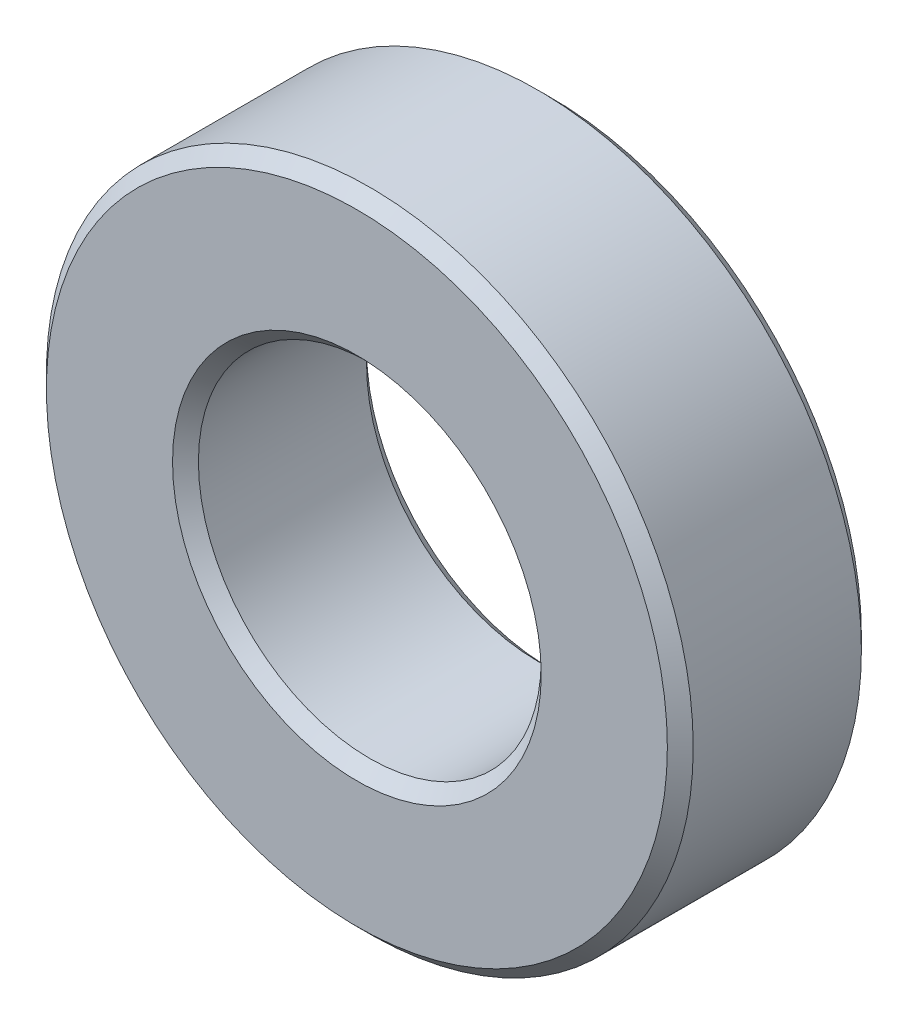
from build123d import *

# Parameters (mm, degrees)
SKETCH1_R           = 5
SKETCH1_R_2         = 2.65
BOSS_EXTRUDE2_DEPTH = 1.5
CHAMFER3_SIZE       = 0.2


with BuildPart() as part:
    # Sketch1 → Boss-Extrude2 (new, symmetric)
    with BuildSketch(Plane.XY):
        Circle(SKETCH1_R)
        Circle(SKETCH1_R_2, mode=Mode.SUBTRACT)
    extrude(amount=BOSS_EXTRUDE2_DEPTH, both=True)

    # Chamfer3
    chamfer3_edges = [part.edges().sort_by_distance(p)[0] for p in [
        (-5, 0, -1.5),
        (-5, 0, 1.5),
        (-2.65, 0, -1.5),
        (-2.65, 0, 1.5),
    ]]
    chamfer(chamfer3_edges, length=CHAMFER3_SIZE)


solid = part.part
